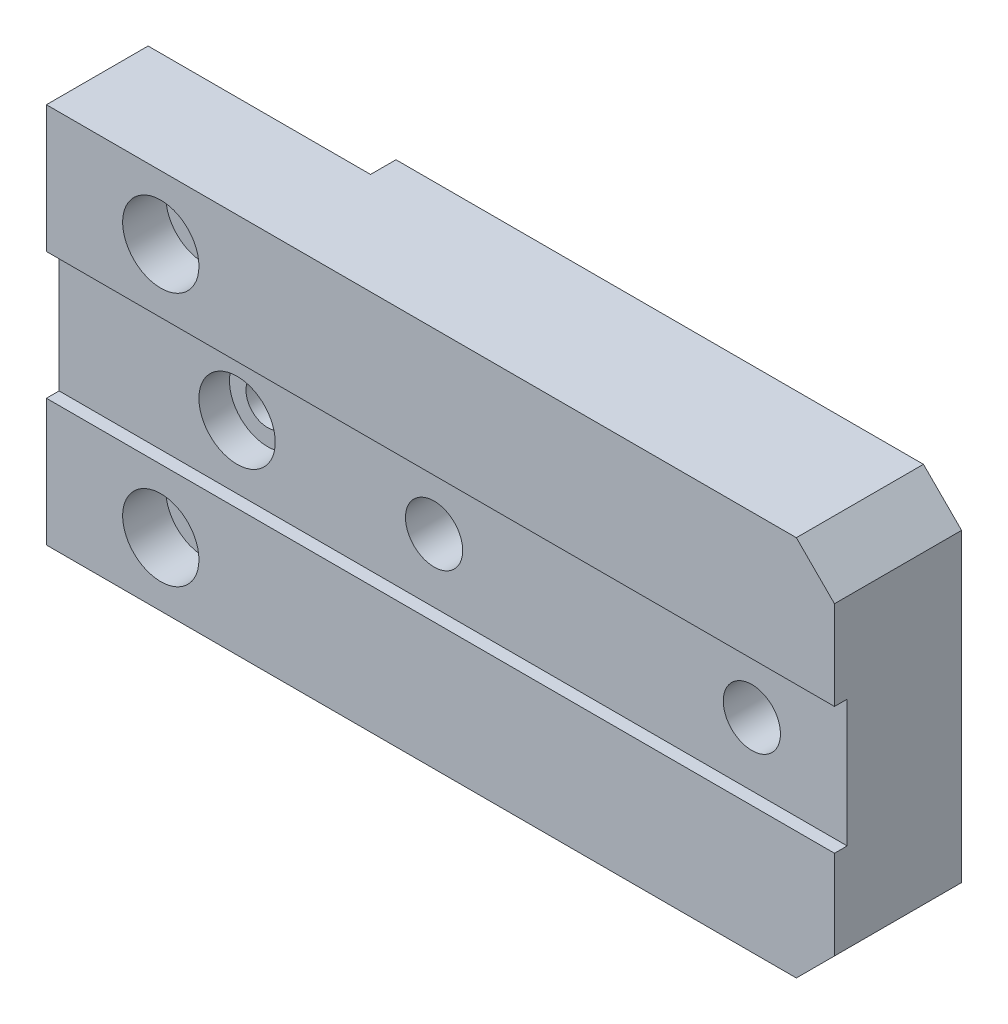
ISO-10303-21;
HEADER;
FILE_DESCRIPTION(('STEP AP214'),'2;1');
FILE_NAME('part.step','',(''),(''),'','','');
FILE_SCHEMA(('AUTOMOTIVE_DESIGN { 1 0 10303 214 1 1 1 1 }'));
ENDSEC;
DATA;
#1=APPLICATION_CONTEXT('core data for automotive mechanical design processes');
#2=APPLICATION_PROTOCOL_DEFINITION('international standard','automotive_design',2000,#1);
#3=PRODUCT_CONTEXT('',#1,'mechanical');
#4=PRODUCT('Part','Part','',(#3));
#5=PRODUCT_RELATED_PRODUCT_CATEGORY('part','',(#4));
#6=PRODUCT_DEFINITION_FORMATION('','',#4);
#7=PRODUCT_DEFINITION_CONTEXT('part definition',#1,'design');
#8=PRODUCT_DEFINITION('design','',#6,#7);
#9=PRODUCT_DEFINITION_SHAPE('','',#8);
#10=(LENGTH_UNIT() NAMED_UNIT(*) SI_UNIT(.MILLI.,.METRE.));
#11=(NAMED_UNIT(*) PLANE_ANGLE_UNIT() SI_UNIT($,.RADIAN.));
#12=(NAMED_UNIT(*) SI_UNIT($,.STERADIAN.) SOLID_ANGLE_UNIT());
#13=UNCERTAINTY_MEASURE_WITH_UNIT(LENGTH_MEASURE(1.E-05),#10,'distance_accuracy_value','');
#14=(GEOMETRIC_REPRESENTATION_CONTEXT(3) GLOBAL_UNCERTAINTY_ASSIGNED_CONTEXT((#13)) GLOBAL_UNIT_ASSIGNED_CONTEXT((#10,
#11,#12)) REPRESENTATION_CONTEXT('',''));
#15=CARTESIAN_POINT('',(0.,0.,0.));
#16=DIRECTION('',(0.,0.,1.));
#17=DIRECTION('',(1.,0.,0.));
#18=AXIS2_PLACEMENT_3D('',#15,#16,#17);
#19=CARTESIAN_POINT('',(0.,0.,10.));
#20=DIRECTION('',(0.,0.,-1.));
#21=DIRECTION('',(-1.,0.,0.));
#22=AXIS2_PLACEMENT_3D('',#19,#20,#21);
#23=PLANE('',#22);
#24=CARTESIAN_POINT('',(5.8,10.,10.));
#25=DIRECTION('',(0.,0.,1.));
#26=DIRECTION('',(1.,0.,0.));
#27=AXIS2_PLACEMENT_3D('',#24,#25,#26);
#28=CIRCLE('',#27,3.);
#29=CARTESIAN_POINT('',(8.8,10.,10.));
#30=VERTEX_POINT('',#29);
#31=EDGE_CURVE('E151',#30,#30,#28,.T.);
#32=ORIENTED_EDGE('',*,*,#31,.F.);
#33=EDGE_LOOP('',(#32));
#34=FACE_BOUND('',#33,.T.);
#35=DIRECTION('',(0.,1.,0.));
#36=VECTOR('',#35,1.);
#37=CARTESIAN_POINT('',(58.8,-15.,10.));
#38=LINE('',#37,#36);
#39=CARTESIAN_POINT('',(58.8,5.,10.));
#40=VERTEX_POINT('',#39);
#41=CARTESIAN_POINT('',(58.8,12.,10.));
#42=VERTEX_POINT('',#41);
#43=EDGE_CURVE('E203',#40,#42,#38,.T.);
#44=ORIENTED_EDGE('',*,*,#43,.T.);
#45=DIRECTION('',(0.707106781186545,-0.70710678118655,0.));
#46=VECTOR('',#45,1.);
#47=CARTESIAN_POINT('',(55.8,15.,10.));
#48=LINE('',#47,#46);
#49=CARTESIAN_POINT('',(55.8,15.,10.));
#50=VERTEX_POINT('',#49);
#51=EDGE_CURVE('E11',#42,#50,#48,.F.);
#52=ORIENTED_EDGE('',*,*,#51,.T.);
#53=DIRECTION('',(-1.,0.,0.));
#54=VECTOR('',#53,1.);
#55=CARTESIAN_POINT('',(-3.2,15.,10.));
#56=LINE('',#55,#54);
#57=CARTESIAN_POINT('',(-3.2,15.,10.));
#58=VERTEX_POINT('',#57);
#59=EDGE_CURVE('E206',#50,#58,#56,.T.);
#60=ORIENTED_EDGE('',*,*,#59,.T.);
#61=DIRECTION('',(0.,-1.,0.));
#62=VECTOR('',#61,1.);
#63=CARTESIAN_POINT('',(-3.2,-15.,10.));
#64=LINE('',#63,#62);
#65=CARTESIAN_POINT('',(-3.2,5.,10.));
#66=VERTEX_POINT('',#65);
#67=EDGE_CURVE('E198',#58,#66,#64,.T.);
#68=ORIENTED_EDGE('',*,*,#67,.T.);
#69=DIRECTION('',(1.,0.,0.));
#70=VECTOR('',#69,1.);
#71=CARTESIAN_POINT('',(-3.2,5.,10.));
#72=LINE('',#71,#70);
#73=EDGE_CURVE('E145',#66,#40,#72,.T.);
#74=ORIENTED_EDGE('',*,*,#73,.T.);
#75=EDGE_LOOP('',(#44,#52,#60,#68,#74));
#76=FACE_BOUND('',#75,.T.);
#77=ADVANCED_FACE('F16',(#34,#76),#23,.F.);
#78=CARTESIAN_POINT('',(-3.2,-15.,10.));
#79=DIRECTION('',(1.,0.,0.));
#80=DIRECTION('',(0.,0.,-1.));
#81=AXIS2_PLACEMENT_3D('',#78,#79,#80);
#82=PLANE('',#81);
#83=DIRECTION('',(0.,1.,0.));
#84=VECTOR('',#83,1.);
#85=CARTESIAN_POINT('',(-3.2,5.,9.));
#86=LINE('',#85,#84);
#87=CARTESIAN_POINT('',(-3.2,-5.,9.));
#88=VERTEX_POINT('',#87);
#89=CARTESIAN_POINT('',(-3.2,5.,9.));
#90=VERTEX_POINT('',#89);
#91=EDGE_CURVE('E121',#88,#90,#86,.T.);
#92=ORIENTED_EDGE('',*,*,#91,.T.);
#93=DIRECTION('',(0.,0.,1.));
#94=VECTOR('',#93,1.);
#95=CARTESIAN_POINT('',(-3.2,5.,10.));
#96=LINE('',#95,#94);
#97=EDGE_CURVE('E127',#90,#66,#96,.T.);
#98=ORIENTED_EDGE('',*,*,#97,.T.);
#99=ORIENTED_EDGE('',*,*,#67,.F.);
#100=DIRECTION('',(0.,0.,-1.));
#101=VECTOR('',#100,1.);
#102=CARTESIAN_POINT('',(-3.2,15.,10.));
#103=LINE('',#102,#101);
#104=CARTESIAN_POINT('',(-3.2,15.,2.));
#105=VERTEX_POINT('',#104);
#106=EDGE_CURVE('E208',#58,#105,#103,.T.);
#107=ORIENTED_EDGE('',*,*,#106,.T.);
#108=DIRECTION('',(0.,1.,0.));
#109=VECTOR('',#108,1.);
#110=CARTESIAN_POINT('',(-3.2,-15.,2.));
#111=LINE('',#110,#109);
#112=CARTESIAN_POINT('',(-3.2,-15.,2.));
#113=VERTEX_POINT('',#112);
#114=EDGE_CURVE('E185',#113,#105,#111,.T.);
#115=ORIENTED_EDGE('',*,*,#114,.F.);
#116=DIRECTION('',(0.,0.,-1.));
#117=VECTOR('',#116,1.);
#118=CARTESIAN_POINT('',(-3.2,-15.,10.));
#119=LINE('',#118,#117);
#120=CARTESIAN_POINT('',(-3.2,-15.,10.));
#121=VERTEX_POINT('',#120);
#122=EDGE_CURVE('E217',#121,#113,#119,.T.);
#123=ORIENTED_EDGE('',*,*,#122,.F.);
#124=CARTESIAN_POINT('',(-3.2,-5.,10.));
#125=VERTEX_POINT('',#124);
#126=EDGE_CURVE('E132',#125,#121,#64,.T.);
#127=ORIENTED_EDGE('',*,*,#126,.F.);
#128=DIRECTION('',(0.,0.,-1.));
#129=VECTOR('',#128,1.);
#130=CARTESIAN_POINT('',(-3.2,-5.,10.));
#131=LINE('',#130,#129);
#132=EDGE_CURVE('E110',#125,#88,#131,.T.);
#133=ORIENTED_EDGE('',*,*,#132,.T.);
#134=EDGE_LOOP('',(#92,#98,#99,#107,#115,#123,#127,#133));
#135=FACE_BOUND('',#134,.T.);
#136=ADVANCED_FACE('F130',(#135),#82,.F.);
#137=CARTESIAN_POINT('',(-3.2,-15.,10.));
#138=DIRECTION('',(0.,1.,0.));
#139=DIRECTION('',(0.,0.,1.));
#140=AXIS2_PLACEMENT_3D('',#137,#138,#139);
#141=PLANE('',#140);
#142=DIRECTION('',(1.,0.,0.));
#143=VECTOR('',#142,1.);
#144=CARTESIAN_POINT('',(-3.2,-15.,0.));
#145=LINE('',#144,#143);
#146=CARTESIAN_POINT('',(14.3,-15.,0.));
#147=VERTEX_POINT('',#146);
#148=CARTESIAN_POINT('',(55.8,-15.,0.));
#149=VERTEX_POINT('',#148);
#150=EDGE_CURVE('E194',#147,#149,#145,.T.);
#151=ORIENTED_EDGE('',*,*,#150,.T.);
#152=DIRECTION('',(0.,0.,1.));
#153=VECTOR('',#152,1.);
#154=CARTESIAN_POINT('',(55.8,-15.,10.));
#155=LINE('',#154,#153);
#156=CARTESIAN_POINT('',(55.8,-15.,10.));
#157=VERTEX_POINT('',#156);
#158=EDGE_CURVE('E37',#149,#157,#155,.T.);
#159=ORIENTED_EDGE('',*,*,#158,.T.);
#160=DIRECTION('',(1.,0.,0.));
#161=VECTOR('',#160,1.);
#162=CARTESIAN_POINT('',(-3.2,-15.,10.));
#163=LINE('',#162,#161);
#164=EDGE_CURVE('E201',#121,#157,#163,.T.);
#165=ORIENTED_EDGE('',*,*,#164,.F.);
#166=ORIENTED_EDGE('',*,*,#122,.T.);
#167=DIRECTION('',(1.,0.,0.));
#168=VECTOR('',#167,1.);
#169=CARTESIAN_POINT('',(-3.2,-15.,2.));
#170=LINE('',#169,#168);
#171=CARTESIAN_POINT('',(14.3,-15.,2.));
#172=VERTEX_POINT('',#171);
#173=EDGE_CURVE('E178',#113,#172,#170,.T.);
#174=ORIENTED_EDGE('',*,*,#173,.T.);
#175=DIRECTION('',(0.,0.,-1.));
#176=VECTOR('',#175,1.);
#177=CARTESIAN_POINT('',(14.3,-15.,0.));
#178=LINE('',#177,#176);
#179=EDGE_CURVE('E181',#172,#147,#178,.T.);
#180=ORIENTED_EDGE('',*,*,#179,.T.);
#181=EDGE_LOOP('',(#151,#159,#165,#166,#174,#180));
#182=FACE_BOUND('',#181,.T.);
#183=ADVANCED_FACE('F261',(#182),#141,.F.);
#184=CARTESIAN_POINT('',(58.8,-15.,10.));
#185=DIRECTION('',(-1.,0.,0.));
#186=DIRECTION('',(0.,0.,1.));
#187=AXIS2_PLACEMENT_3D('',#184,#185,#186);
#188=PLANE('',#187);
#189=CARTESIAN_POINT('',(58.8,-12.,10.));
#190=VERTEX_POINT('',#189);
#191=CARTESIAN_POINT('',(58.8,-5.,10.));
#192=VERTEX_POINT('',#191);
#193=EDGE_CURVE('E204',#190,#192,#38,.T.);
#194=ORIENTED_EDGE('',*,*,#193,.F.);
#195=DIRECTION('',(0.,0.,-1.));
#196=VECTOR('',#195,1.);
#197=CARTESIAN_POINT('',(58.8,-12.,10.));
#198=LINE('',#197,#196);
#199=CARTESIAN_POINT('',(58.8,-12.,0.));
#200=VERTEX_POINT('',#199);
#201=EDGE_CURVE('E237',#190,#200,#198,.T.);
#202=ORIENTED_EDGE('',*,*,#201,.T.);
#203=DIRECTION('',(0.,1.,0.));
#204=VECTOR('',#203,1.);
#205=CARTESIAN_POINT('',(58.8,-15.,0.));
#206=LINE('',#205,#204);
#207=CARTESIAN_POINT('',(58.8,12.,0.));
#208=VERTEX_POINT('',#207);
#209=EDGE_CURVE('E210',#200,#208,#206,.T.);
#210=ORIENTED_EDGE('',*,*,#209,.T.);
#211=DIRECTION('',(0.,0.,1.));
#212=VECTOR('',#211,1.);
#213=CARTESIAN_POINT('',(58.8,12.,10.));
#214=LINE('',#213,#212);
#215=EDGE_CURVE('E220',#208,#42,#214,.T.);
#216=ORIENTED_EDGE('',*,*,#215,.T.);
#217=ORIENTED_EDGE('',*,*,#43,.F.);
#218=DIRECTION('',(0.,0.,1.));
#219=VECTOR('',#218,1.);
#220=CARTESIAN_POINT('',(58.8,5.,10.));
#221=LINE('',#220,#219);
#222=CARTESIAN_POINT('',(58.8,5.,9.));
#223=VERTEX_POINT('',#222);
#224=EDGE_CURVE('E133',#223,#40,#221,.T.);
#225=ORIENTED_EDGE('',*,*,#224,.F.);
#226=DIRECTION('',(0.,1.,0.));
#227=VECTOR('',#226,1.);
#228=CARTESIAN_POINT('',(58.8,5.,9.));
#229=LINE('',#228,#227);
#230=CARTESIAN_POINT('',(58.8,-5.,9.));
#231=VERTEX_POINT('',#230);
#232=EDGE_CURVE('E135',#231,#223,#229,.T.);
#233=ORIENTED_EDGE('',*,*,#232,.F.);
#234=DIRECTION('',(0.,0.,-1.));
#235=VECTOR('',#234,1.);
#236=CARTESIAN_POINT('',(58.8,-5.,10.));
#237=LINE('',#236,#235);
#238=EDGE_CURVE('E113',#192,#231,#237,.T.);
#239=ORIENTED_EDGE('',*,*,#238,.F.);
#240=EDGE_LOOP('',(#194,#202,#210,#216,#217,#225,#233,#239));
#241=FACE_BOUND('',#240,.T.);
#242=ADVANCED_FACE('F272',(#241),#188,.F.);
#243=CARTESIAN_POINT('',(-3.2,15.,10.));
#244=DIRECTION('',(0.,-1.,0.));
#245=DIRECTION('',(0.,0.,-1.));
#246=AXIS2_PLACEMENT_3D('',#243,#244,#245);
#247=PLANE('',#246);
#248=ORIENTED_EDGE('',*,*,#59,.F.);
#249=DIRECTION('',(0.,0.,-1.));
#250=VECTOR('',#249,1.);
#251=CARTESIAN_POINT('',(55.8,15.,10.));
#252=LINE('',#251,#250);
#253=CARTESIAN_POINT('',(55.8,15.,0.));
#254=VERTEX_POINT('',#253);
#255=EDGE_CURVE('E24',#50,#254,#252,.T.);
#256=ORIENTED_EDGE('',*,*,#255,.T.);
#257=DIRECTION('',(-1.,0.,0.));
#258=VECTOR('',#257,1.);
#259=CARTESIAN_POINT('',(-3.2,15.,0.));
#260=LINE('',#259,#258);
#261=CARTESIAN_POINT('',(14.3,15.,0.));
#262=VERTEX_POINT('',#261);
#263=EDGE_CURVE('E213',#254,#262,#260,.T.);
#264=ORIENTED_EDGE('',*,*,#263,.T.);
#265=DIRECTION('',(0.,0.,-1.));
#266=VECTOR('',#265,1.);
#267=CARTESIAN_POINT('',(14.3,15.,0.));
#268=LINE('',#267,#266);
#269=CARTESIAN_POINT('',(14.3,15.,2.));
#270=VERTEX_POINT('',#269);
#271=EDGE_CURVE('E182',#270,#262,#268,.T.);
#272=ORIENTED_EDGE('',*,*,#271,.F.);
#273=DIRECTION('',(1.,0.,0.));
#274=VECTOR('',#273,1.);
#275=CARTESIAN_POINT('',(-3.2,15.,2.));
#276=LINE('',#275,#274);
#277=EDGE_CURVE('E186',#105,#270,#276,.T.);
#278=ORIENTED_EDGE('',*,*,#277,.F.);
#279=ORIENTED_EDGE('',*,*,#106,.F.);
#280=EDGE_LOOP('',(#248,#256,#264,#272,#278,#279));
#281=FACE_BOUND('',#280,.T.);
#282=ADVANCED_FACE('F250',(#281),#247,.F.);
#283=CARTESIAN_POINT('',(5.8,-10.,10.));
#284=DIRECTION('',(0.,0.,1.));
#285=DIRECTION('',(1.,0.,0.));
#286=AXIS2_PLACEMENT_3D('',#283,#284,#285);
#287=CIRCLE('',#286,3.);
#288=CARTESIAN_POINT('',(8.8,-10.,10.));
#289=VERTEX_POINT('',#288);
#290=EDGE_CURVE('E168',#289,#289,#287,.T.);
#291=ORIENTED_EDGE('',*,*,#290,.F.);
#292=EDGE_LOOP('',(#291));
#293=FACE_BOUND('',#292,.T.);
#294=ORIENTED_EDGE('',*,*,#164,.T.);
#295=DIRECTION('',(-0.707106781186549,-0.707106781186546,0.));
#296=VECTOR('',#295,1.);
#297=CARTESIAN_POINT('',(58.8,-12.,10.));
#298=LINE('',#297,#296);
#299=EDGE_CURVE('E245',#157,#190,#298,.F.);
#300=ORIENTED_EDGE('',*,*,#299,.T.);
#301=ORIENTED_EDGE('',*,*,#193,.T.);
#302=DIRECTION('',(1.,0.,0.));
#303=VECTOR('',#302,1.);
#304=CARTESIAN_POINT('',(-3.2,-5.,10.));
#305=LINE('',#304,#303);
#306=EDGE_CURVE('E118',#125,#192,#305,.T.);
#307=ORIENTED_EDGE('',*,*,#306,.F.);
#308=ORIENTED_EDGE('',*,*,#126,.T.);
#309=EDGE_LOOP('',(#294,#300,#301,#307,#308));
#310=FACE_BOUND('',#309,.T.);
#311=ADVANCED_FACE('F286',(#293,#310),#23,.F.);
#312=CARTESIAN_POINT('',(0.,0.,0.));
#313=DIRECTION('',(0.,0.,-1.));
#314=DIRECTION('',(-1.,0.,0.));
#315=AXIS2_PLACEMENT_3D('',#312,#313,#314);
#316=PLANE('',#315);
#317=CARTESIAN_POINT('',(26.3,0.,0.));
#318=DIRECTION('',(0.,0.,-1.));
#319=DIRECTION('',(-1.,0.,0.));
#320=AXIS2_PLACEMENT_3D('',#317,#318,#319);
#321=CIRCLE('',#320,4.025);
#322=CARTESIAN_POINT('',(22.275,0.,0.));
#323=VERTEX_POINT('',#322);
#324=EDGE_CURVE('E615',#323,#323,#321,.T.);
#325=ORIENTED_EDGE('',*,*,#324,.F.);
#326=EDGE_LOOP('',(#325));
#327=FACE_BOUND('',#326,.T.);
#328=CARTESIAN_POINT('',(51.3,0.,0.));
#329=DIRECTION('',(0.,0.,-1.));
#330=DIRECTION('',(-1.,0.,0.));
#331=AXIS2_PLACEMENT_3D('',#328,#329,#330);
#332=CIRCLE('',#331,4.025);
#333=CARTESIAN_POINT('',(47.275,0.,0.));
#334=VERTEX_POINT('',#333);
#335=EDGE_CURVE('E234',#334,#334,#332,.T.);
#336=ORIENTED_EDGE('',*,*,#335,.F.);
#337=EDGE_LOOP('',(#336));
#338=FACE_BOUND('',#337,.T.);
#339=ORIENTED_EDGE('',*,*,#209,.F.);
#340=DIRECTION('',(0.707106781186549,0.707106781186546,0.));
#341=VECTOR('',#340,1.);
#342=CARTESIAN_POINT('',(35.4,-35.4,0.));
#343=LINE('',#342,#341);
#344=EDGE_CURVE('E242',#200,#149,#343,.F.);
#345=ORIENTED_EDGE('',*,*,#344,.T.);
#346=ORIENTED_EDGE('',*,*,#150,.F.);
#347=DIRECTION('',(0.,1.,0.));
#348=VECTOR('',#347,1.);
#349=CARTESIAN_POINT('',(14.3,-15.,0.));
#350=LINE('',#349,#348);
#351=EDGE_CURVE('E191',#147,#262,#350,.T.);
#352=ORIENTED_EDGE('',*,*,#351,.T.);
#353=ORIENTED_EDGE('',*,*,#263,.F.);
#354=DIRECTION('',(-0.707106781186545,0.70710678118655,0.));
#355=VECTOR('',#354,1.);
#356=CARTESIAN_POINT('',(35.4,35.4,0.));
#357=LINE('',#356,#355);
#358=EDGE_CURVE('E240',#254,#208,#357,.F.);
#359=ORIENTED_EDGE('',*,*,#358,.T.);
#360=EDGE_LOOP('',(#339,#345,#346,#352,#353,#359));
#361=FACE_BOUND('',#360,.T.);
#362=ADVANCED_FACE('F256',(#327,#338,#361),#316,.T.);
#363=CARTESIAN_POINT('',(14.3,-15.,0.));
#364=DIRECTION('',(1.,0.,0.));
#365=DIRECTION('',(0.,0.,-1.));
#366=AXIS2_PLACEMENT_3D('',#363,#364,#365);
#367=PLANE('',#366);
#368=ORIENTED_EDGE('',*,*,#271,.T.);
#369=ORIENTED_EDGE('',*,*,#351,.F.);
#370=ORIENTED_EDGE('',*,*,#179,.F.);
#371=DIRECTION('',(0.,1.,0.));
#372=VECTOR('',#371,1.);
#373=CARTESIAN_POINT('',(14.3,-15.,2.));
#374=LINE('',#373,#372);
#375=EDGE_CURVE('E195',#172,#270,#374,.T.);
#376=ORIENTED_EDGE('',*,*,#375,.T.);
#377=EDGE_LOOP('',(#368,#369,#370,#376));
#378=FACE_BOUND('',#377,.T.);
#379=ADVANCED_FACE('F260',(#378),#367,.F.);
#380=CARTESIAN_POINT('',(-3.2,-15.,2.));
#381=DIRECTION('',(0.,0.,1.));
#382=DIRECTION('',(1.,0.,0.));
#383=AXIS2_PLACEMENT_3D('',#380,#381,#382);
#384=PLANE('',#383);
#385=CARTESIAN_POINT('',(5.8,10.,2.));
#386=DIRECTION('',(0.,0.,1.));
#387=DIRECTION('',(1.,0.,0.));
#388=AXIS2_PLACEMENT_3D('',#385,#386,#387);
#389=CIRCLE('',#388,1.7);
#390=CARTESIAN_POINT('',(7.5,10.,2.));
#391=VERTEX_POINT('',#390);
#392=EDGE_CURVE('E160',#391,#391,#389,.T.);
#393=ORIENTED_EDGE('',*,*,#392,.T.);
#394=EDGE_LOOP('',(#393));
#395=FACE_BOUND('',#394,.T.);
#396=CARTESIAN_POINT('',(10.8,0.,2.));
#397=DIRECTION('',(0.,0.,1.));
#398=DIRECTION('',(1.,0.,0.));
#399=AXIS2_PLACEMENT_3D('',#396,#397,#398);
#400=CIRCLE('',#399,1.7);
#401=CARTESIAN_POINT('',(12.5,0.,2.));
#402=VERTEX_POINT('',#401);
#403=EDGE_CURVE('E167',#402,#402,#400,.T.);
#404=ORIENTED_EDGE('',*,*,#403,.T.);
#405=EDGE_LOOP('',(#404));
#406=FACE_BOUND('',#405,.T.);
#407=CARTESIAN_POINT('',(5.8,-10.,2.));
#408=DIRECTION('',(0.,0.,1.));
#409=DIRECTION('',(1.,0.,0.));
#410=AXIS2_PLACEMENT_3D('',#407,#408,#409);
#411=CIRCLE('',#410,1.7);
#412=CARTESIAN_POINT('',(7.5,-10.,2.));
#413=VERTEX_POINT('',#412);
#414=EDGE_CURVE('E177',#413,#413,#411,.T.);
#415=ORIENTED_EDGE('',*,*,#414,.T.);
#416=EDGE_LOOP('',(#415));
#417=FACE_BOUND('',#416,.T.);
#418=ORIENTED_EDGE('',*,*,#277,.T.);
#419=ORIENTED_EDGE('',*,*,#375,.F.);
#420=ORIENTED_EDGE('',*,*,#173,.F.);
#421=ORIENTED_EDGE('',*,*,#114,.T.);
#422=EDGE_LOOP('',(#418,#419,#420,#421));
#423=FACE_BOUND('',#422,.T.);
#424=ADVANCED_FACE('F264',(#395,#406,#417,#423),#384,.F.);
#425=CARTESIAN_POINT('',(5.8,-10.,10.));
#426=DIRECTION('',(0.,0.,1.));
#427=DIRECTION('',(1.,0.,0.));
#428=AXIS2_PLACEMENT_3D('',#425,#426,#427);
#429=CYLINDRICAL_SURFACE('',#428,1.7);
#430=CARTESIAN_POINT('',(5.8,-10.,6.6));
#431=DIRECTION('',(0.,0.,1.));
#432=DIRECTION('',(1.,0.,0.));
#433=AXIS2_PLACEMENT_3D('',#430,#431,#432);
#434=CIRCLE('',#433,1.7);
#435=CARTESIAN_POINT('',(7.5,-10.,6.6));
#436=VERTEX_POINT('',#435);
#437=EDGE_CURVE('E174',#436,#436,#434,.T.);
#438=ORIENTED_EDGE('',*,*,#437,.T.);
#439=EDGE_LOOP('',(#438));
#440=FACE_BOUND('',#439,.T.);
#441=ORIENTED_EDGE('',*,*,#414,.F.);
#442=EDGE_LOOP('',(#441));
#443=FACE_BOUND('',#442,.T.);
#444=ADVANCED_FACE('F323',(#440,#443),#429,.F.);
#445=CARTESIAN_POINT('',(7.5,-10.,6.6));
#446=DIRECTION('',(0.,0.,-1.));
#447=DIRECTION('',(-1.,0.,0.));
#448=AXIS2_PLACEMENT_3D('',#445,#446,#447);
#449=PLANE('',#448);
#450=ORIENTED_EDGE('',*,*,#437,.F.);
#451=EDGE_LOOP('',(#450));
#452=FACE_BOUND('',#451,.T.);
#453=CARTESIAN_POINT('',(5.8,-10.,6.6));
#454=DIRECTION('',(0.,0.,1.));
#455=DIRECTION('',(1.,0.,0.));
#456=AXIS2_PLACEMENT_3D('',#453,#454,#455);
#457=CIRCLE('',#456,3.);
#458=CARTESIAN_POINT('',(8.8,-10.,6.6));
#459=VERTEX_POINT('',#458);
#460=EDGE_CURVE('E171',#459,#459,#457,.T.);
#461=ORIENTED_EDGE('',*,*,#460,.T.);
#462=EDGE_LOOP('',(#461));
#463=FACE_BOUND('',#462,.T.);
#464=ADVANCED_FACE('F312',(#452,#463),#449,.F.);
#465=CARTESIAN_POINT('',(5.8,-10.,10.));
#466=DIRECTION('',(0.,0.,1.));
#467=DIRECTION('',(1.,0.,0.));
#468=AXIS2_PLACEMENT_3D('',#465,#466,#467);
#469=CYLINDRICAL_SURFACE('',#468,3.);
#470=ORIENTED_EDGE('',*,*,#460,.F.);
#471=EDGE_LOOP('',(#470));
#472=FACE_BOUND('',#471,.T.);
#473=ORIENTED_EDGE('',*,*,#290,.T.);
#474=EDGE_LOOP('',(#473));
#475=FACE_BOUND('',#474,.T.);
#476=ADVANCED_FACE('F309',(#472,#475),#469,.F.);
#477=CARTESIAN_POINT('',(10.8,0.,10.));
#478=DIRECTION('',(0.,0.,1.));
#479=DIRECTION('',(1.,0.,0.));
#480=AXIS2_PLACEMENT_3D('',#477,#478,#479);
#481=CYLINDRICAL_SURFACE('',#480,1.7);
#482=CARTESIAN_POINT('',(10.8,0.,6.6));
#483=DIRECTION('',(0.,0.,1.));
#484=DIRECTION('',(1.,0.,0.));
#485=AXIS2_PLACEMENT_3D('',#482,#483,#484);
#486=CIRCLE('',#485,1.7);
#487=CARTESIAN_POINT('',(12.5,0.,6.6));
#488=VERTEX_POINT('',#487);
#489=EDGE_CURVE('E164',#488,#488,#486,.T.);
#490=ORIENTED_EDGE('',*,*,#489,.T.);
#491=EDGE_LOOP('',(#490));
#492=FACE_BOUND('',#491,.T.);
#493=ORIENTED_EDGE('',*,*,#403,.F.);
#494=EDGE_LOOP('',(#493));
#495=FACE_BOUND('',#494,.T.);
#496=ADVANCED_FACE('F311',(#492,#495),#481,.F.);
#497=CARTESIAN_POINT('',(12.5,0.,6.6));
#498=DIRECTION('',(0.,0.,-1.));
#499=DIRECTION('',(-1.,0.,0.));
#500=AXIS2_PLACEMENT_3D('',#497,#498,#499);
#501=PLANE('',#500);
#502=ORIENTED_EDGE('',*,*,#489,.F.);
#503=EDGE_LOOP('',(#502));
#504=FACE_BOUND('',#503,.T.);
#505=CARTESIAN_POINT('',(10.8,0.,6.6));
#506=DIRECTION('',(0.,0.,1.));
#507=DIRECTION('',(1.,0.,0.));
#508=AXIS2_PLACEMENT_3D('',#505,#506,#507);
#509=CIRCLE('',#508,3.);
#510=CARTESIAN_POINT('',(13.8,0.,6.6));
#511=VERTEX_POINT('',#510);
#512=EDGE_CURVE('E161',#511,#511,#509,.T.);
#513=ORIENTED_EDGE('',*,*,#512,.T.);
#514=EDGE_LOOP('',(#513));
#515=FACE_BOUND('',#514,.T.);
#516=ADVANCED_FACE('F320',(#504,#515),#501,.F.);
#517=CARTESIAN_POINT('',(10.8,0.,10.));
#518=DIRECTION('',(0.,0.,1.));
#519=DIRECTION('',(1.,0.,0.));
#520=AXIS2_PLACEMENT_3D('',#517,#518,#519);
#521=CYLINDRICAL_SURFACE('',#520,3.);
#522=CARTESIAN_POINT('',(10.8,0.,9.));
#523=DIRECTION('',(0.,0.,-1.));
#524=DIRECTION('',(-1.,0.,0.));
#525=AXIS2_PLACEMENT_3D('',#522,#523,#524);
#526=CIRCLE('',#525,3.);
#527=CARTESIAN_POINT('',(7.8,0.,9.));
#528=VERTEX_POINT('',#527);
#529=EDGE_CURVE('E148',#528,#528,#526,.F.);
#530=ORIENTED_EDGE('',*,*,#529,.T.);
#531=EDGE_LOOP('',(#530));
#532=FACE_BOUND('',#531,.T.);
#533=ORIENTED_EDGE('',*,*,#512,.F.);
#534=EDGE_LOOP('',(#533));
#535=FACE_BOUND('',#534,.T.);
#536=ADVANCED_FACE('F349',(#532,#535),#521,.F.);
#537=CARTESIAN_POINT('',(5.8,10.,10.));
#538=DIRECTION('',(0.,0.,1.));
#539=DIRECTION('',(1.,0.,0.));
#540=AXIS2_PLACEMENT_3D('',#537,#538,#539);
#541=CYLINDRICAL_SURFACE('',#540,1.7);
#542=CARTESIAN_POINT('',(5.8,10.,6.6));
#543=DIRECTION('',(0.,0.,1.));
#544=DIRECTION('',(1.,0.,0.));
#545=AXIS2_PLACEMENT_3D('',#542,#543,#544);
#546=CIRCLE('',#545,1.7);
#547=CARTESIAN_POINT('',(7.5,10.,6.6));
#548=VERTEX_POINT('',#547);
#549=EDGE_CURVE('E157',#548,#548,#546,.T.);
#550=ORIENTED_EDGE('',*,*,#549,.T.);
#551=EDGE_LOOP('',(#550));
#552=FACE_BOUND('',#551,.T.);
#553=ORIENTED_EDGE('',*,*,#392,.F.);
#554=EDGE_LOOP('',(#553));
#555=FACE_BOUND('',#554,.T.);
#556=ADVANCED_FACE('F346',(#552,#555),#541,.F.);
#557=CARTESIAN_POINT('',(7.5,10.,6.6));
#558=DIRECTION('',(0.,0.,-1.));
#559=DIRECTION('',(-1.,0.,0.));
#560=AXIS2_PLACEMENT_3D('',#557,#558,#559);
#561=PLANE('',#560);
#562=ORIENTED_EDGE('',*,*,#549,.F.);
#563=EDGE_LOOP('',(#562));
#564=FACE_BOUND('',#563,.T.);
#565=CARTESIAN_POINT('',(5.8,10.,6.6));
#566=DIRECTION('',(0.,0.,1.));
#567=DIRECTION('',(1.,0.,0.));
#568=AXIS2_PLACEMENT_3D('',#565,#566,#567);
#569=CIRCLE('',#568,3.);
#570=CARTESIAN_POINT('',(8.8,10.,6.6));
#571=VERTEX_POINT('',#570);
#572=EDGE_CURVE('E154',#571,#571,#569,.T.);
#573=ORIENTED_EDGE('',*,*,#572,.T.);
#574=EDGE_LOOP('',(#573));
#575=FACE_BOUND('',#574,.T.);
#576=ADVANCED_FACE('F348',(#564,#575),#561,.F.);
#577=CARTESIAN_POINT('',(5.8,10.,10.));
#578=DIRECTION('',(0.,0.,1.));
#579=DIRECTION('',(1.,0.,0.));
#580=AXIS2_PLACEMENT_3D('',#577,#578,#579);
#581=CYLINDRICAL_SURFACE('',#580,3.);
#582=ORIENTED_EDGE('',*,*,#572,.F.);
#583=EDGE_LOOP('',(#582));
#584=FACE_BOUND('',#583,.T.);
#585=ORIENTED_EDGE('',*,*,#31,.T.);
#586=EDGE_LOOP('',(#585));
#587=FACE_BOUND('',#586,.T.);
#588=ADVANCED_FACE('F357',(#584,#587),#581,.F.);
#589=CARTESIAN_POINT('',(-3.2,5.,9.));
#590=DIRECTION('',(0.,0.,-1.));
#591=DIRECTION('',(-1.,0.,0.));
#592=AXIS2_PLACEMENT_3D('',#589,#590,#591);
#593=PLANE('',#592);
#594=CARTESIAN_POINT('',(26.3,0.,9.));
#595=DIRECTION('',(0.,0.,-1.));
#596=DIRECTION('',(-1.,0.,0.));
#597=AXIS2_PLACEMENT_3D('',#594,#595,#596);
#598=CIRCLE('',#597,2.25);
#599=CARTESIAN_POINT('',(24.05,0.,9.));
#600=VERTEX_POINT('',#599);
#601=EDGE_CURVE('E231',#600,#600,#598,.T.);
#602=ORIENTED_EDGE('',*,*,#601,.T.);
#603=EDGE_LOOP('',(#602));
#604=FACE_BOUND('',#603,.T.);
#605=CARTESIAN_POINT('',(51.3,0.,9.));
#606=DIRECTION('',(0.,0.,-1.));
#607=DIRECTION('',(-1.,0.,0.));
#608=AXIS2_PLACEMENT_3D('',#605,#606,#607);
#609=CIRCLE('',#608,2.25);
#610=CARTESIAN_POINT('',(49.05,0.,9.));
#611=VERTEX_POINT('',#610);
#612=EDGE_CURVE('E143',#611,#611,#609,.T.);
#613=ORIENTED_EDGE('',*,*,#612,.T.);
#614=EDGE_LOOP('',(#613));
#615=FACE_BOUND('',#614,.T.);
#616=ORIENTED_EDGE('',*,*,#232,.T.);
#617=DIRECTION('',(1.,0.,0.));
#618=VECTOR('',#617,1.);
#619=CARTESIAN_POINT('',(-3.2,5.,9.));
#620=LINE('',#619,#618);
#621=EDGE_CURVE('E117',#90,#223,#620,.T.);
#622=ORIENTED_EDGE('',*,*,#621,.F.);
#623=ORIENTED_EDGE('',*,*,#91,.F.);
#624=DIRECTION('',(1.,0.,0.));
#625=VECTOR('',#624,1.);
#626=CARTESIAN_POINT('',(-3.2,-5.,9.));
#627=LINE('',#626,#625);
#628=EDGE_CURVE('E105',#88,#231,#627,.T.);
#629=ORIENTED_EDGE('',*,*,#628,.T.);
#630=EDGE_LOOP('',(#616,#622,#623,#629));
#631=FACE_BOUND('',#630,.T.);
#632=ORIENTED_EDGE('',*,*,#529,.F.);
#633=EDGE_LOOP('',(#632));
#634=FACE_BOUND('',#633,.T.);
#635=ADVANCED_FACE('F122',(#604,#615,#631,#634),#593,.F.);
#636=CARTESIAN_POINT('',(-3.2,5.,10.));
#637=DIRECTION('',(0.,1.,0.));
#638=DIRECTION('',(0.,0.,1.));
#639=AXIS2_PLACEMENT_3D('',#636,#637,#638);
#640=PLANE('',#639);
#641=ORIENTED_EDGE('',*,*,#224,.T.);
#642=ORIENTED_EDGE('',*,*,#73,.F.);
#643=ORIENTED_EDGE('',*,*,#97,.F.);
#644=ORIENTED_EDGE('',*,*,#621,.T.);
#645=EDGE_LOOP('',(#641,#642,#643,#644));
#646=FACE_BOUND('',#645,.T.);
#647=ADVANCED_FACE('F410',(#646),#640,.F.);
#648=CARTESIAN_POINT('',(-3.2,-5.,10.));
#649=DIRECTION('',(0.,-1.,0.));
#650=DIRECTION('',(0.,0.,-1.));
#651=AXIS2_PLACEMENT_3D('',#648,#649,#650);
#652=PLANE('',#651);
#653=ORIENTED_EDGE('',*,*,#238,.T.);
#654=ORIENTED_EDGE('',*,*,#628,.F.);
#655=ORIENTED_EDGE('',*,*,#132,.F.);
#656=ORIENTED_EDGE('',*,*,#306,.T.);
#657=EDGE_LOOP('',(#653,#654,#655,#656));
#658=FACE_BOUND('',#657,.T.);
#659=ADVANCED_FACE('F107',(#658),#652,.F.);
#660=CARTESIAN_POINT('',(51.3,0.,0.));
#661=DIRECTION('',(0.,0.,-1.));
#662=DIRECTION('',(-1.,0.,0.));
#663=AXIS2_PLACEMENT_3D('',#660,#661,#662);
#664=CYLINDRICAL_SURFACE('',#663,2.25);
#665=CARTESIAN_POINT('',(51.3,0.,4.625));
#666=DIRECTION('',(0.,0.,-1.));
#667=DIRECTION('',(-1.,0.,0.));
#668=AXIS2_PLACEMENT_3D('',#665,#666,#667);
#669=CIRCLE('',#668,2.25);
#670=CARTESIAN_POINT('',(49.05,0.,4.625));
#671=VERTEX_POINT('',#670);
#672=EDGE_CURVE('E138',#671,#671,#669,.T.);
#673=ORIENTED_EDGE('',*,*,#672,.T.);
#674=EDGE_LOOP('',(#673));
#675=FACE_BOUND('',#674,.T.);
#676=ORIENTED_EDGE('',*,*,#612,.F.);
#677=EDGE_LOOP('',(#676));
#678=FACE_BOUND('',#677,.T.);
#679=ADVANCED_FACE('F428',(#675,#678),#664,.F.);
#680=CARTESIAN_POINT('',(51.3,0.,4.6));
#681=DIRECTION('',(0.,0.,-1.));
#682=DIRECTION('',(-1.,0.,0.));
#683=AXIS2_PLACEMENT_3D('',#680,#681,#682);
#684=CONICAL_SURFACE('',#683,2.275,0.785398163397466);
#685=ORIENTED_EDGE('',*,*,#672,.F.);
#686=EDGE_LOOP('',(#685));
#687=FACE_BOUND('',#686,.T.);
#688=CARTESIAN_POINT('',(51.3,0.,4.6));
#689=DIRECTION('',(0.,0.,-1.));
#690=DIRECTION('',(-1.,0.,0.));
#691=AXIS2_PLACEMENT_3D('',#688,#689,#690);
#692=CIRCLE('',#691,2.275);
#693=CARTESIAN_POINT('',(49.025,0.,4.6));
#694=VERTEX_POINT('',#693);
#695=EDGE_CURVE('E634',#694,#694,#692,.T.);
#696=ORIENTED_EDGE('',*,*,#695,.T.);
#697=EDGE_LOOP('',(#696));
#698=FACE_BOUND('',#697,.T.);
#699=ADVANCED_FACE('F437',(#687,#698),#684,.F.);
#700=CARTESIAN_POINT('',(53.575,0.,4.6));
#701=DIRECTION('',(0.,0.,1.));
#702=DIRECTION('',(1.,0.,0.));
#703=AXIS2_PLACEMENT_3D('',#700,#701,#702);
#704=PLANE('',#703);
#705=ORIENTED_EDGE('',*,*,#695,.F.);
#706=EDGE_LOOP('',(#705));
#707=FACE_BOUND('',#706,.T.);
#708=CARTESIAN_POINT('',(51.3,0.,4.6));
#709=DIRECTION('',(0.,0.,-1.));
#710=DIRECTION('',(-1.,0.,0.));
#711=AXIS2_PLACEMENT_3D('',#708,#709,#710);
#712=CIRCLE('',#711,4.);
#713=CARTESIAN_POINT('',(47.3,0.,4.6));
#714=VERTEX_POINT('',#713);
#715=EDGE_CURVE('E632',#714,#714,#712,.T.);
#716=ORIENTED_EDGE('',*,*,#715,.T.);
#717=EDGE_LOOP('',(#716));
#718=FACE_BOUND('',#717,.T.);
#719=ADVANCED_FACE('F447',(#707,#718),#704,.F.);
#720=CARTESIAN_POINT('',(51.3,0.,0.));
#721=DIRECTION('',(0.,0.,-1.));
#722=DIRECTION('',(-1.,0.,0.));
#723=AXIS2_PLACEMENT_3D('',#720,#721,#722);
#724=CYLINDRICAL_SURFACE('',#723,4.);
#725=ORIENTED_EDGE('',*,*,#715,.F.);
#726=EDGE_LOOP('',(#725));
#727=FACE_BOUND('',#726,.T.);
#728=CARTESIAN_POINT('',(51.3,0.,0.0250000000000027));
#729=DIRECTION('',(0.,0.,-1.));
#730=DIRECTION('',(-1.,0.,0.));
#731=AXIS2_PLACEMENT_3D('',#728,#729,#730);
#732=CIRCLE('',#731,4.);
#733=CARTESIAN_POINT('',(47.3,0.,0.0250000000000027));
#734=VERTEX_POINT('',#733);
#735=EDGE_CURVE('E629',#734,#734,#732,.T.);
#736=ORIENTED_EDGE('',*,*,#735,.T.);
#737=EDGE_LOOP('',(#736));
#738=FACE_BOUND('',#737,.T.);
#739=ADVANCED_FACE('F457',(#727,#738),#724,.F.);
#740=CARTESIAN_POINT('',(51.3,0.,0.));
#741=DIRECTION('',(0.,0.,-1.));
#742=DIRECTION('',(-1.,0.,0.));
#743=AXIS2_PLACEMENT_3D('',#740,#741,#742);
#744=CONICAL_SURFACE('',#743,4.025,0.785398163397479);
#745=ORIENTED_EDGE('',*,*,#735,.F.);
#746=EDGE_LOOP('',(#745));
#747=FACE_BOUND('',#746,.T.);
#748=ORIENTED_EDGE('',*,*,#335,.T.);
#749=EDGE_LOOP('',(#748));
#750=FACE_BOUND('',#749,.T.);
#751=ADVANCED_FACE('F468',(#747,#750),#744,.F.);
#752=CARTESIAN_POINT('',(26.3,0.,0.));
#753=DIRECTION('',(0.,0.,-1.));
#754=DIRECTION('',(-1.,0.,0.));
#755=AXIS2_PLACEMENT_3D('',#752,#753,#754);
#756=CYLINDRICAL_SURFACE('',#755,2.25);
#757=CARTESIAN_POINT('',(26.3,0.,4.625));
#758=DIRECTION('',(0.,0.,-1.));
#759=DIRECTION('',(-1.,0.,0.));
#760=AXIS2_PLACEMENT_3D('',#757,#758,#759);
#761=CIRCLE('',#760,2.25);
#762=CARTESIAN_POINT('',(24.05,0.,4.625));
#763=VERTEX_POINT('',#762);
#764=EDGE_CURVE('E235',#763,#763,#761,.T.);
#765=ORIENTED_EDGE('',*,*,#764,.T.);
#766=EDGE_LOOP('',(#765));
#767=FACE_BOUND('',#766,.T.);
#768=ORIENTED_EDGE('',*,*,#601,.F.);
#769=EDGE_LOOP('',(#768));
#770=FACE_BOUND('',#769,.T.);
#771=ADVANCED_FACE('F480',(#767,#770),#756,.F.);
#772=CARTESIAN_POINT('',(26.3,0.,4.6));
#773=DIRECTION('',(0.,0.,-1.));
#774=DIRECTION('',(-1.,0.,0.));
#775=AXIS2_PLACEMENT_3D('',#772,#773,#774);
#776=CONICAL_SURFACE('',#775,2.275,0.785398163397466);
#777=ORIENTED_EDGE('',*,*,#764,.F.);
#778=EDGE_LOOP('',(#777));
#779=FACE_BOUND('',#778,.T.);
#780=CARTESIAN_POINT('',(26.3,0.,4.6));
#781=DIRECTION('',(0.,0.,-1.));
#782=DIRECTION('',(-1.,0.,0.));
#783=AXIS2_PLACEMENT_3D('',#780,#781,#782);
#784=CIRCLE('',#783,2.275);
#785=CARTESIAN_POINT('',(24.025,0.,4.6));
#786=VERTEX_POINT('',#785);
#787=EDGE_CURVE('E622',#786,#786,#784,.T.);
#788=ORIENTED_EDGE('',*,*,#787,.T.);
#789=EDGE_LOOP('',(#788));
#790=FACE_BOUND('',#789,.T.);
#791=ADVANCED_FACE('F490',(#779,#790),#776,.F.);
#792=CARTESIAN_POINT('',(28.575,0.,4.6));
#793=DIRECTION('',(0.,0.,1.));
#794=DIRECTION('',(1.,0.,0.));
#795=AXIS2_PLACEMENT_3D('',#792,#793,#794);
#796=PLANE('',#795);
#797=ORIENTED_EDGE('',*,*,#787,.F.);
#798=EDGE_LOOP('',(#797));
#799=FACE_BOUND('',#798,.T.);
#800=CARTESIAN_POINT('',(26.3,0.,4.6));
#801=DIRECTION('',(0.,0.,-1.));
#802=DIRECTION('',(-1.,0.,0.));
#803=AXIS2_PLACEMENT_3D('',#800,#801,#802);
#804=CIRCLE('',#803,4.);
#805=CARTESIAN_POINT('',(22.3,0.,4.6));
#806=VERTEX_POINT('',#805);
#807=EDGE_CURVE('E617',#806,#806,#804,.T.);
#808=ORIENTED_EDGE('',*,*,#807,.T.);
#809=EDGE_LOOP('',(#808));
#810=FACE_BOUND('',#809,.T.);
#811=ADVANCED_FACE('F499',(#799,#810),#796,.F.);
#812=CARTESIAN_POINT('',(26.3,0.,0.));
#813=DIRECTION('',(0.,0.,-1.));
#814=DIRECTION('',(-1.,0.,0.));
#815=AXIS2_PLACEMENT_3D('',#812,#813,#814);
#816=CYLINDRICAL_SURFACE('',#815,4.);
#817=ORIENTED_EDGE('',*,*,#807,.F.);
#818=EDGE_LOOP('',(#817));
#819=FACE_BOUND('',#818,.T.);
#820=CARTESIAN_POINT('',(26.3,0.,0.0250000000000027));
#821=DIRECTION('',(0.,0.,-1.));
#822=DIRECTION('',(-1.,0.,0.));
#823=AXIS2_PLACEMENT_3D('',#820,#821,#822);
#824=CIRCLE('',#823,4.);
#825=CARTESIAN_POINT('',(22.3,0.,0.0250000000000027));
#826=VERTEX_POINT('',#825);
#827=EDGE_CURVE('E612',#826,#826,#824,.T.);
#828=ORIENTED_EDGE('',*,*,#827,.T.);
#829=EDGE_LOOP('',(#828));
#830=FACE_BOUND('',#829,.T.);
#831=ADVANCED_FACE('F509',(#819,#830),#816,.F.);
#832=CARTESIAN_POINT('',(26.3,0.,0.));
#833=DIRECTION('',(0.,0.,-1.));
#834=DIRECTION('',(-1.,0.,0.));
#835=AXIS2_PLACEMENT_3D('',#832,#833,#834);
#836=CONICAL_SURFACE('',#835,4.025,0.785398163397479);
#837=ORIENTED_EDGE('',*,*,#827,.F.);
#838=EDGE_LOOP('',(#837));
#839=FACE_BOUND('',#838,.T.);
#840=ORIENTED_EDGE('',*,*,#324,.T.);
#841=EDGE_LOOP('',(#840));
#842=FACE_BOUND('',#841,.T.);
#843=ADVANCED_FACE('F281',(#839,#842),#836,.F.);
#844=CARTESIAN_POINT('',(58.8,-12.,10.));
#845=DIRECTION('',(-0.707106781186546,0.707106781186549,0.));
#846=DIRECTION('',(0.,0.,-1.));
#847=AXIS2_PLACEMENT_3D('',#844,#845,#846);
#848=PLANE('',#847);
#849=ORIENTED_EDGE('',*,*,#299,.F.);
#850=ORIENTED_EDGE('',*,*,#158,.F.);
#851=ORIENTED_EDGE('',*,*,#344,.F.);
#852=ORIENTED_EDGE('',*,*,#201,.F.);
#853=EDGE_LOOP('',(#849,#850,#851,#852));
#854=FACE_BOUND('',#853,.T.);
#855=ADVANCED_FACE('F275',(#854),#848,.F.);
#856=CARTESIAN_POINT('',(55.8,15.,10.));
#857=DIRECTION('',(-0.70710678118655,-0.707106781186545,0.));
#858=DIRECTION('',(0.,0.,-1.));
#859=AXIS2_PLACEMENT_3D('',#856,#857,#858);
#860=PLANE('',#859);
#861=ORIENTED_EDGE('',*,*,#51,.F.);
#862=ORIENTED_EDGE('',*,*,#215,.F.);
#863=ORIENTED_EDGE('',*,*,#358,.F.);
#864=ORIENTED_EDGE('',*,*,#255,.F.);
#865=EDGE_LOOP('',(#861,#862,#863,#864));
#866=FACE_BOUND('',#865,.T.);
#867=ADVANCED_FACE('F18',(#866),#860,.F.);
#868=CLOSED_SHELL('',(#77,#136,#183,#242,#282,#311,#362,#379,#424,#444,#464,#476,#496,#516,#536,
#556,#576,#588,#635,#647,#659,#679,#699,#719,#739,#751,#771,#791,#811,#831,#843,#855,#867));
#869=MANIFOLD_SOLID_BREP('B1',#868);
#870=ADVANCED_BREP_SHAPE_REPRESENTATION('',(#18,#869),#14);
#871=SHAPE_DEFINITION_REPRESENTATION(#9,#870);
ENDSEC;
END-ISO-10303-21;
